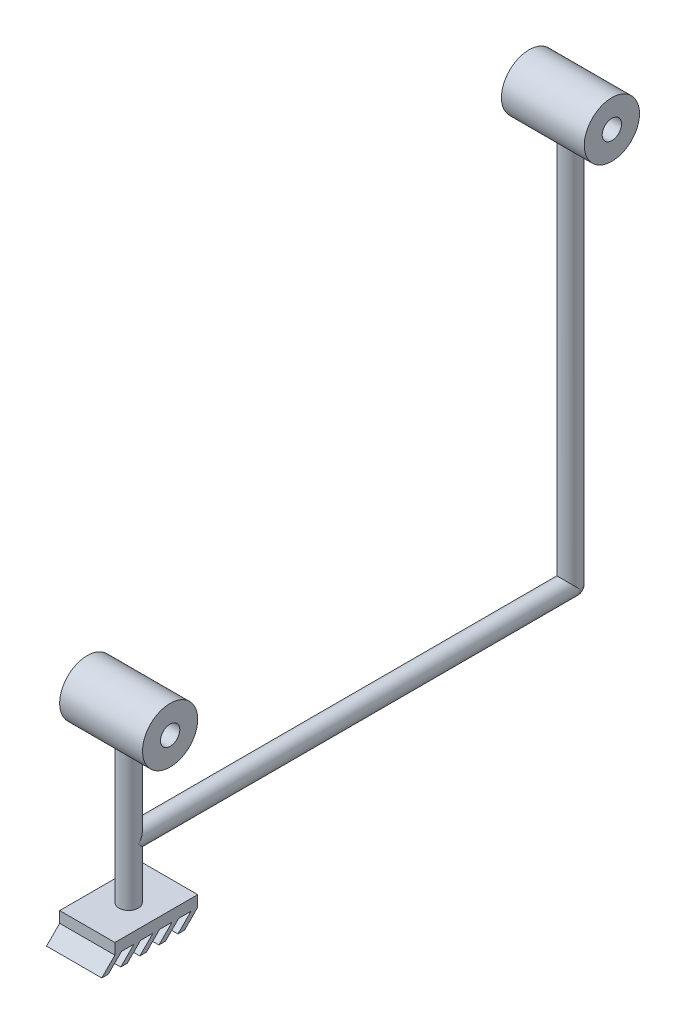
ISO-10303-21;
HEADER;
FILE_DESCRIPTION(('STEP AP214'),'2;1');
FILE_NAME('part.step','',(''),(''),'','','');
FILE_SCHEMA(('AUTOMOTIVE_DESIGN { 1 0 10303 214 1 1 1 1 }'));
ENDSEC;
DATA;
#1=APPLICATION_CONTEXT('core data for automotive mechanical design processes');
#2=APPLICATION_PROTOCOL_DEFINITION('international standard','automotive_design',2000,#1);
#3=PRODUCT_CONTEXT('',#1,'mechanical');
#4=PRODUCT('Part','Part','',(#3));
#5=PRODUCT_RELATED_PRODUCT_CATEGORY('part','',(#4));
#6=PRODUCT_DEFINITION_FORMATION('','',#4);
#7=PRODUCT_DEFINITION_CONTEXT('part definition',#1,'design');
#8=PRODUCT_DEFINITION('design','',#6,#7);
#9=PRODUCT_DEFINITION_SHAPE('','',#8);
#10=(LENGTH_UNIT() NAMED_UNIT(*) SI_UNIT(.MILLI.,.METRE.));
#11=(NAMED_UNIT(*) PLANE_ANGLE_UNIT() SI_UNIT($,.RADIAN.));
#12=(NAMED_UNIT(*) SI_UNIT($,.STERADIAN.) SOLID_ANGLE_UNIT());
#13=UNCERTAINTY_MEASURE_WITH_UNIT(LENGTH_MEASURE(1.E-05),#10,'distance_accuracy_value','');
#14=(GEOMETRIC_REPRESENTATION_CONTEXT(3) GLOBAL_UNCERTAINTY_ASSIGNED_CONTEXT((#13)) GLOBAL_UNIT_ASSIGNED_CONTEXT((#10,
#11,#12)) REPRESENTATION_CONTEXT('',''));
#15=CARTESIAN_POINT('',(0.,0.,0.));
#16=DIRECTION('',(0.,0.,1.));
#17=DIRECTION('',(1.,0.,0.));
#18=AXIS2_PLACEMENT_3D('',#15,#16,#17);
#19=CARTESIAN_POINT('',(10.,-24.,15.));
#20=DIRECTION('',(0.,1.,0.));
#21=DIRECTION('',(0.,0.,1.));
#22=AXIS2_PLACEMENT_3D('',#19,#20,#21);
#23=PLANE('',#22);
#24=DIRECTION('',(0.,0.,-1.));
#25=VECTOR('',#24,1.);
#26=CARTESIAN_POINT('',(-10.,-24.,15.));
#27=LINE('',#26,#25);
#28=CARTESIAN_POINT('',(-10.,-24.,-8.08471434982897));
#29=VERTEX_POINT('',#28);
#30=CARTESIAN_POINT('',(-10.,-24.,-12.6));
#31=VERTEX_POINT('',#30);
#32=EDGE_CURVE('E361',#29,#31,#27,.T.);
#33=ORIENTED_EDGE('',*,*,#32,.T.);
#34=DIRECTION('',(1.,0.,0.));
#35=VECTOR('',#34,1.);
#36=CARTESIAN_POINT('',(-18.5982098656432,-24.,-12.6));
#37=LINE('',#36,#35);
#38=CARTESIAN_POINT('',(10.,-24.,-12.6));
#39=VERTEX_POINT('',#38);
#40=EDGE_CURVE('E50',#31,#39,#37,.T.);
#41=ORIENTED_EDGE('',*,*,#40,.T.);
#42=DIRECTION('',(0.,0.,1.));
#43=VECTOR('',#42,1.);
#44=CARTESIAN_POINT('',(10.,-24.,15.));
#45=LINE('',#44,#43);
#46=CARTESIAN_POINT('',(10.,-24.,-8.08471434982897));
#47=VERTEX_POINT('',#46);
#48=EDGE_CURVE('E36',#39,#47,#45,.T.);
#49=ORIENTED_EDGE('',*,*,#48,.T.);
#50=DIRECTION('',(1.,0.,0.));
#51=VECTOR('',#50,1.);
#52=CARTESIAN_POINT('',(-18.5982098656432,-24.,-8.08471434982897));
#53=LINE('',#52,#51);
#54=EDGE_CURVE('E256',#29,#47,#53,.T.);
#55=ORIENTED_EDGE('',*,*,#54,.F.);
#56=EDGE_LOOP('',(#33,#41,#49,#55));
#57=FACE_BOUND('',#56,.T.);
#58=ADVANCED_FACE('F32',(#57),#23,.F.);
#59=CARTESIAN_POINT('',(-10.,-24.,-1.18471434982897));
#60=VERTEX_POINT('',#59);
#61=CARTESIAN_POINT('',(-10.,-24.,-5.7));
#62=VERTEX_POINT('',#61);
#63=EDGE_CURVE('E346',#60,#62,#27,.T.);
#64=ORIENTED_EDGE('',*,*,#63,.T.);
#65=DIRECTION('',(1.,0.,0.));
#66=VECTOR('',#65,1.);
#67=CARTESIAN_POINT('',(-18.5982098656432,-24.,-5.70000000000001));
#68=LINE('',#67,#66);
#69=CARTESIAN_POINT('',(10.,-24.,-5.70000000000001));
#70=VERTEX_POINT('',#69);
#71=EDGE_CURVE('E243',#62,#70,#68,.T.);
#72=ORIENTED_EDGE('',*,*,#71,.T.);
#73=CARTESIAN_POINT('',(10.,-24.,-1.18471434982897));
#74=VERTEX_POINT('',#73);
#75=EDGE_CURVE('E365',#70,#74,#45,.T.);
#76=ORIENTED_EDGE('',*,*,#75,.T.);
#77=DIRECTION('',(1.,0.,0.));
#78=VECTOR('',#77,1.);
#79=CARTESIAN_POINT('',(-18.5982098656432,-24.,-1.18471434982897));
#80=LINE('',#79,#78);
#81=EDGE_CURVE('E281',#60,#74,#80,.T.);
#82=ORIENTED_EDGE('',*,*,#81,.F.);
#83=EDGE_LOOP('',(#64,#72,#76,#82));
#84=FACE_BOUND('',#83,.T.);
#85=ADVANCED_FACE('F502',(#84),#23,.F.);
#86=CARTESIAN_POINT('',(-10.,-24.,5.71528565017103));
#87=VERTEX_POINT('',#86);
#88=CARTESIAN_POINT('',(-10.,-24.,1.2));
#89=VERTEX_POINT('',#88);
#90=EDGE_CURVE('E344',#87,#89,#27,.T.);
#91=ORIENTED_EDGE('',*,*,#90,.T.);
#92=DIRECTION('',(1.,0.,0.));
#93=VECTOR('',#92,1.);
#94=CARTESIAN_POINT('',(-18.5982098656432,-24.,1.2));
#95=LINE('',#94,#93);
#96=CARTESIAN_POINT('',(10.,-24.,1.2));
#97=VERTEX_POINT('',#96);
#98=EDGE_CURVE('E267',#89,#97,#95,.T.);
#99=ORIENTED_EDGE('',*,*,#98,.T.);
#100=CARTESIAN_POINT('',(10.,-24.,5.71528565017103));
#101=VERTEX_POINT('',#100);
#102=EDGE_CURVE('E364',#97,#101,#45,.T.);
#103=ORIENTED_EDGE('',*,*,#102,.T.);
#104=DIRECTION('',(1.,0.,0.));
#105=VECTOR('',#104,1.);
#106=CARTESIAN_POINT('',(-18.5982098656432,-24.,5.71528565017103));
#107=LINE('',#106,#105);
#108=EDGE_CURVE('E306',#87,#101,#107,.T.);
#109=ORIENTED_EDGE('',*,*,#108,.F.);
#110=EDGE_LOOP('',(#91,#99,#103,#109));
#111=FACE_BOUND('',#110,.T.);
#112=ADVANCED_FACE('F506',(#111),#23,.F.);
#113=CARTESIAN_POINT('',(-10.,-24.,12.615285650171));
#114=VERTEX_POINT('',#113);
#115=CARTESIAN_POINT('',(-10.,-24.,8.1));
#116=VERTEX_POINT('',#115);
#117=EDGE_CURVE('E332',#114,#116,#27,.T.);
#118=ORIENTED_EDGE('',*,*,#117,.T.);
#119=DIRECTION('',(1.,0.,0.));
#120=VECTOR('',#119,1.);
#121=CARTESIAN_POINT('',(-18.5982098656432,-24.,8.1));
#122=LINE('',#121,#120);
#123=CARTESIAN_POINT('',(10.,-24.,8.1));
#124=VERTEX_POINT('',#123);
#125=EDGE_CURVE('E292',#116,#124,#122,.T.);
#126=ORIENTED_EDGE('',*,*,#125,.T.);
#127=CARTESIAN_POINT('',(10.,-24.,12.615285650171));
#128=VERTEX_POINT('',#127);
#129=EDGE_CURVE('E347',#124,#128,#45,.T.);
#130=ORIENTED_EDGE('',*,*,#129,.T.);
#131=DIRECTION('',(1.,0.,0.));
#132=VECTOR('',#131,1.);
#133=CARTESIAN_POINT('',(-18.5982098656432,-24.,12.615285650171));
#134=LINE('',#133,#132);
#135=EDGE_CURVE('E317',#114,#128,#134,.T.);
#136=ORIENTED_EDGE('',*,*,#135,.F.);
#137=EDGE_LOOP('',(#118,#126,#130,#136));
#138=FACE_BOUND('',#137,.T.);
#139=ADVANCED_FACE('F428',(#138),#23,.F.);
#140=CARTESIAN_POINT('',(10.,-24.,-15.));
#141=VERTEX_POINT('',#140);
#142=CARTESIAN_POINT('',(10.,-24.,-14.984714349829));
#143=VERTEX_POINT('',#142);
#144=EDGE_CURVE('E58',#141,#143,#45,.T.);
#145=ORIENTED_EDGE('',*,*,#144,.T.);
#146=DIRECTION('',(1.,0.,0.));
#147=VECTOR('',#146,1.);
#148=CARTESIAN_POINT('',(-18.5982098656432,-24.,-14.984714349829));
#149=LINE('',#148,#147);
#150=CARTESIAN_POINT('',(-10.,-24.,-14.984714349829));
#151=VERTEX_POINT('',#150);
#152=EDGE_CURVE('E234',#151,#143,#149,.T.);
#153=ORIENTED_EDGE('',*,*,#152,.F.);
#154=CARTESIAN_POINT('',(-10.,-24.,-15.));
#155=VERTEX_POINT('',#154);
#156=EDGE_CURVE('E363',#151,#155,#27,.T.);
#157=ORIENTED_EDGE('',*,*,#156,.T.);
#158=DIRECTION('',(1.,0.,0.));
#159=VECTOR('',#158,1.);
#160=CARTESIAN_POINT('',(10.,-24.,-15.));
#161=LINE('',#160,#159);
#162=EDGE_CURVE('E353',#155,#141,#161,.T.);
#163=ORIENTED_EDGE('',*,*,#162,.T.);
#164=EDGE_LOOP('',(#145,#153,#157,#163));
#165=FACE_BOUND('',#164,.T.);
#166=ADVANCED_FACE('F425',(#165),#23,.F.);
#167=CARTESIAN_POINT('',(0.,0.,-160.));
#168=DIRECTION('',(0.,0.,1.));
#169=DIRECTION('',(1.,0.,0.));
#170=AXIS2_PLACEMENT_3D('',#167,#168,#169);
#171=CYLINDRICAL_SURFACE('',#170,3.5);
#172=CARTESIAN_POINT('',(0.,0.,-160.));
#173=DIRECTION('',(0.,0.,1.));
#174=DIRECTION('',(1.,0.,0.));
#175=AXIS2_PLACEMENT_3D('',#172,#173,#174);
#176=CIRCLE('',#175,3.5);
#177=CARTESIAN_POINT('',(-3.5,0.,-160.));
#178=VERTEX_POINT('',#177);
#179=CARTESIAN_POINT('',(3.5,0.,-160.));
#180=VERTEX_POINT('',#179);
#181=EDGE_CURVE('E583',#178,#180,#176,.T.);
#182=ORIENTED_EDGE('',*,*,#181,.T.);
#183=CARTESIAN_POINT('',(0.,0.,-160.));
#184=DIRECTION('',(0.,-0.707106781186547,0.707106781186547));
#185=DIRECTION('',(0.,0.707106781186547,0.707106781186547));
#186=AXIS2_PLACEMENT_3D('',#183,#184,#185);
#187=ELLIPSE('',#186,4.94974746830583,3.5);
#188=EDGE_CURVE('E572',#180,#178,#187,.T.);
#189=ORIENTED_EDGE('',*,*,#188,.T.);
#190=EDGE_LOOP('',(#182,#189));
#191=FACE_BOUND('',#190,.T.);
#192=CARTESIAN_POINT('',(0.,0.,0.));
#193=DIRECTION('',(0.,0.707106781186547,0.707106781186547));
#194=DIRECTION('',(0.,-0.707106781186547,0.707106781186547));
#195=AXIS2_PLACEMENT_3D('',#192,#193,#194);
#196=ELLIPSE('',#195,4.94974746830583,3.5);
#197=CARTESIAN_POINT('',(-3.5,0.,0.));
#198=VERTEX_POINT('',#197);
#199=CARTESIAN_POINT('',(3.5,0.,0.));
#200=VERTEX_POINT('',#199);
#201=EDGE_CURVE('E581',#198,#200,#196,.F.);
#202=ORIENTED_EDGE('',*,*,#201,.T.);
#203=CARTESIAN_POINT('',(0.,0.,0.));
#204=DIRECTION('',(0.,-0.707106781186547,0.707106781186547));
#205=DIRECTION('',(0.,0.707106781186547,0.707106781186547));
#206=AXIS2_PLACEMENT_3D('',#203,#204,#205);
#207=ELLIPSE('',#206,4.94974746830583,3.5);
#208=EDGE_CURVE('E561',#200,#198,#207,.F.);
#209=ORIENTED_EDGE('',*,*,#208,.T.);
#210=EDGE_LOOP('',(#202,#209));
#211=FACE_BOUND('',#210,.T.);
#212=ADVANCED_FACE('F34',(#191,#211),#171,.T.);
#213=CARTESIAN_POINT('',(0.,150.,-160.));
#214=DIRECTION('',(0.,-1.,0.));
#215=DIRECTION('',(0.,0.,-1.));
#216=AXIS2_PLACEMENT_3D('',#213,#214,#215);
#217=CYLINDRICAL_SURFACE('',#216,3.5);
#218=ORIENTED_EDGE('',*,*,#188,.F.);
#219=CARTESIAN_POINT('',(0.,0.,-160.));
#220=DIRECTION('',(0.,1.,0.));
#221=DIRECTION('',(0.,0.,1.));
#222=AXIS2_PLACEMENT_3D('',#219,#220,#221);
#223=CIRCLE('',#222,3.5);
#224=EDGE_CURVE('E569',#180,#178,#223,.T.);
#225=ORIENTED_EDGE('',*,*,#224,.T.);
#226=EDGE_LOOP('',(#218,#225));
#227=FACE_BOUND('',#226,.T.);
#228=CARTESIAN_POINT('',(0.,140.632503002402,-163.5));
#229=CARTESIAN_POINT('',(-0.190015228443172,140.632505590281,-163.500003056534));
#230=CARTESIAN_POINT('',(-0.380009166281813,140.626658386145,-163.484474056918));
#231=CARTESIAN_POINT('',(-0.754329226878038,140.604038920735,-163.423005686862));
#232=CARTESIAN_POINT('',(-0.938654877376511,140.587265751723,-163.377063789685));
#233=CARTESIAN_POINT('',(-1.29614668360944,140.544922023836,-163.256612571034));
#234=CARTESIAN_POINT('',(-1.46933564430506,140.519370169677,-163.182163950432));
#235=CARTESIAN_POINT('',(-1.80082676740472,140.462376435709,-163.007023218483));
#236=CARTESIAN_POINT('',(-1.95912513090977,140.430933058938,-162.906324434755));
#237=CARTESIAN_POINT('',(-2.26317861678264,140.364176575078,-162.676882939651));
#238=CARTESIAN_POINT('',(-2.40819784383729,140.328760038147,-162.547194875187));
#239=CARTESIAN_POINT('',(-2.67493749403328,140.258917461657,-162.265469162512));
#240=CARTESIAN_POINT('',(-2.79665372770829,140.224491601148,-162.113427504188));
#241=CARTESIAN_POINT('',(-3.01675012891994,140.159299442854,-161.785850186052));
#242=CARTESIAN_POINT('',(-3.11434809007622,140.128668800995,-161.609759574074));
#243=CARTESIAN_POINT('',(-3.27823961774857,140.075746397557,-161.242401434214));
#244=CARTESIAN_POINT('',(-3.34454254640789,140.053452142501,-161.051138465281));
#245=CARTESIAN_POINT('',(-3.44143357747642,140.020447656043,-160.666588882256));
#246=CARTESIAN_POINT('',(-3.47328474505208,140.009328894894,-160.473656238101));
#247=CARTESIAN_POINT('',(-3.50439617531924,139.998471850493,-160.084885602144));
#248=CARTESIAN_POINT('',(-3.50366568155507,139.998730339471,-159.889048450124));
#249=CARTESIAN_POINT('',(-3.47041038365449,140.0103283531,-159.50901145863));
#250=CARTESIAN_POINT('',(-3.43925996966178,140.021188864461,-159.324674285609));
#251=CARTESIAN_POINT('',(-3.34833697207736,140.052158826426,-158.964031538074));
#252=CARTESIAN_POINT('',(-3.28856240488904,140.072268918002,-158.7877265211));
#253=CARTESIAN_POINT('',(-3.14135069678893,140.120061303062,-158.445285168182));
#254=CARTESIAN_POINT('',(-3.05354374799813,140.147844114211,-158.27932241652));
#255=CARTESIAN_POINT('',(-2.853072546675,140.208120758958,-157.964098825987));
#256=CARTESIAN_POINT('',(-2.74040091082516,140.240615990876,-157.814842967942));
#257=CARTESIAN_POINT('',(-2.48658785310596,140.308898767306,-157.529120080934));
#258=CARTESIAN_POINT('',(-2.3442779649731,140.34476967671,-157.393709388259));
#259=CARTESIAN_POINT('',(-2.03869601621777,140.414376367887,-157.148311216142));
#260=CARTESIAN_POINT('',(-1.87542000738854,140.448111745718,-157.038328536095));
#261=CARTESIAN_POINT('',(-1.52887993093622,140.510111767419,-156.845238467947));
#262=CARTESIAN_POINT('',(-1.34532137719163,140.538272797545,-156.762623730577));
#263=CARTESIAN_POINT('',(-0.965658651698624,140.584740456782,-156.629852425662));
#264=CARTESIAN_POINT('',(-0.769560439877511,140.603051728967,-156.579680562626));
#265=CARTESIAN_POINT('',(-0.38070325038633,140.626678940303,-156.515466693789));
#266=CARTESIAN_POINT('',(-0.188253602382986,140.632589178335,-156.499770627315));
#267=CARTESIAN_POINT('',(0.19657916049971,140.632414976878,-156.500234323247));
#268=CARTESIAN_POINT('',(0.38896228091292,140.626333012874,-156.516387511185));
#269=CARTESIAN_POINT('',(0.760318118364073,140.603456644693,-156.578599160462));
#270=CARTESIAN_POINT('',(0.939520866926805,140.587091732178,-156.623459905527));
#271=CARTESIAN_POINT('',(1.28780306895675,140.545980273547,-156.740349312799));
#272=CARTESIAN_POINT('',(1.45688060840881,140.521232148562,-156.812383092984));
#273=CARTESIAN_POINT('',(1.78650944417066,140.465100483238,-156.984354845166));
#274=CARTESIAN_POINT('',(1.94657352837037,140.433519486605,-157.085160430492));
#275=CARTESIAN_POINT('',(2.24810844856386,140.367643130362,-157.31085499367));
#276=CARTESIAN_POINT('',(2.38957324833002,140.333346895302,-157.435751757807));
#277=CARTESIAN_POINT('',(2.65778728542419,140.26366880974,-157.714067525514));
#278=CARTESIAN_POINT('',(2.78333219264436,140.228328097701,-157.86866111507));
#279=CARTESIAN_POINT('',(3.00680180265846,140.162346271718,-158.197594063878));
#280=CARTESIAN_POINT('',(3.10472714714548,140.131705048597,-158.371932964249));
#281=CARTESIAN_POINT('',(3.26935426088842,140.078678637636,-158.734783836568));
#282=CARTESIAN_POINT('',(3.33622971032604,140.056247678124,-158.923209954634));
#283=CARTESIAN_POINT('',(3.43702558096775,140.021980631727,-159.309585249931));
#284=CARTESIAN_POINT('',(3.47095926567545,140.010140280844,-159.507530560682));
#285=CARTESIAN_POINT('',(3.50362041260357,139.998742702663,-159.896363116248));
#286=CARTESIAN_POINT('',(3.50406912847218,139.998584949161,-160.087089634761));
#287=CARTESIAN_POINT('',(3.47406390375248,140.009057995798,-160.465775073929));
#288=CARTESIAN_POINT('',(3.44361291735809,140.019687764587,-160.653734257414));
#289=CARTESIAN_POINT('',(3.35384530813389,140.05029876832,-161.01796363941));
#290=CARTESIAN_POINT('',(3.29508802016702,140.070098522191,-161.19438805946));
#291=CARTESIAN_POINT('',(3.15090729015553,140.11700528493,-161.53492402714));
#292=CARTESIAN_POINT('',(3.06547889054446,140.144113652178,-161.699033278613));
#293=CARTESIAN_POINT('',(2.86654561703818,140.204196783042,-162.017300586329));
#294=CARTESIAN_POINT('',(2.75207211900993,140.23735973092,-162.170817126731));
#295=CARTESIAN_POINT('',(2.49989733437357,140.305426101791,-162.45701356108));
#296=CARTESIAN_POINT('',(2.36218826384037,140.340330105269,-162.589686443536));
#297=CARTESIAN_POINT('',(2.06016290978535,140.409808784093,-162.836442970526));
#298=CARTESIAN_POINT('',(1.89493733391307,140.444300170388,-162.949440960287));
#299=CARTESIAN_POINT('',(1.54675228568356,140.507203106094,-163.146030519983));
#300=CARTESIAN_POINT('',(1.36379511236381,140.535615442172,-163.229625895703));
#301=CARTESIAN_POINT('',(0.987195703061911,140.582457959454,-163.363768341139));
#302=CARTESIAN_POINT('',(0.793694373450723,140.600995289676,-163.414671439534));
#303=CARTESIAN_POINT('',(0.400118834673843,140.626013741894,-163.482778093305));
#304=CARTESIAN_POINT('',(0.200047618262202,140.63250027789,-163.499996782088));
#305=CARTESIAN_POINT('',(0.,140.632503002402,-163.5));
#306=B_SPLINE_CURVE_WITH_KNOTS('',3,(#228,#229,#230,#231,#232,#233,#234,#235,#236,#237,#238,
#239,#240,#241,#242,#243,#244,#245,#246,#247,#248,#249,#250,#251,#252,#253,#254,#255,#256,#257,
#258,#259,#260,#261,#262,#263,#264,#265,#266,#267,#268,#269,#270,#271,#272,#273,#274,#275,#276,
#277,#278,#279,#280,#281,#282,#283,#284,#285,#286,#287,#288,#289,#290,#291,#292,#293,#294,#295,
#296,#297,#298,#299,#300,#301,#302,#303,#304,#305),.UNSPECIFIED.,.T.,.F.,(4,2,2,2,2,2,2,2,2,2,2,
2,2,2,2,2,2,2,2,2,2,2,2,2,2,2,2,2,2,2,2,2,2,2,2,2,2,2,4),(0.,0.569303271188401,1.13865384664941,
1.70679875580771,2.27508821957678,2.86567632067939,3.456370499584,4.06425497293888,
4.67195747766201,5.25653473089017,5.84094613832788,6.40011991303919,6.95933244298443,
7.52625023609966,8.09333659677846,8.68966509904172,9.2861060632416,9.89276413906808,
10.499135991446,11.0757147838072,11.6521745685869,12.2060258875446,12.7599815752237,
13.3328233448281,13.9058505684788,14.5097673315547,15.1136700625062,15.7141528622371,
16.3143937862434,16.8837576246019,17.4530670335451,18.0115615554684,18.5701599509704,
19.150637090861,19.7313090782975,20.3377389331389,20.9440902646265,21.5437209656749,
22.1430822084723),.UNSPECIFIED.);
#307=CARTESIAN_POINT('',(0.,140.632503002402,-163.5));
#308=VERTEX_POINT('',#307);
#309=EDGE_CURVE('E11',#308,#308,#306,.T.);
#310=ORIENTED_EDGE('',*,*,#309,.F.);
#311=EDGE_LOOP('',(#310));
#312=FACE_BOUND('',#311,.T.);
#313=ADVANCED_FACE('F392',(#227,#312),#217,.T.);
#314=CARTESIAN_POINT('',(0.,40.,0.));
#315=DIRECTION('',(0.,-1.,0.));
#316=DIRECTION('',(0.,0.,-1.));
#317=AXIS2_PLACEMENT_3D('',#314,#315,#316);
#318=CYLINDRICAL_SURFACE('',#317,3.5);
#319=ORIENTED_EDGE('',*,*,#201,.F.);
#320=ORIENTED_EDGE('',*,*,#208,.F.);
#321=EDGE_LOOP('',(#319,#320));
#322=FACE_BOUND('',#321,.T.);
#323=CARTESIAN_POINT('',(0.,30.6325030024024,-3.5));
#324=CARTESIAN_POINT('',(-0.19001522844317,30.6325055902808,-3.50000305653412));
#325=CARTESIAN_POINT('',(-0.380009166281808,30.6266583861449,-3.48447405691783));
#326=CARTESIAN_POINT('',(-0.754329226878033,30.6040389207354,-3.42300568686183));
#327=CARTESIAN_POINT('',(-0.938654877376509,30.5872657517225,-3.37706378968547));
#328=CARTESIAN_POINT('',(-1.29614668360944,30.5449220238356,-3.2566125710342));
#329=CARTESIAN_POINT('',(-1.46933564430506,30.5193701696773,-3.18216395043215));
#330=CARTESIAN_POINT('',(-1.80082676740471,30.462376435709,-3.00702321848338));
#331=CARTESIAN_POINT('',(-1.95912513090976,30.4309330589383,-2.90632443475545));
#332=CARTESIAN_POINT('',(-2.26317861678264,30.3641765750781,-2.67688293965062));
#333=CARTESIAN_POINT('',(-2.40819784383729,30.3287600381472,-2.54719487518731));
#334=CARTESIAN_POINT('',(-2.67493749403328,30.2589174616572,-2.26546916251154));
#335=CARTESIAN_POINT('',(-2.79665372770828,30.2244916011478,-2.11342750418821));
#336=CARTESIAN_POINT('',(-3.01675012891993,30.159299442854,-1.78585018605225));
#337=CARTESIAN_POINT('',(-3.11434809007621,30.1286688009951,-1.60975957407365));
#338=CARTESIAN_POINT('',(-3.27823961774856,30.0757463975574,-1.2424014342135));
#339=CARTESIAN_POINT('',(-3.34454254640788,30.0534521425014,-1.05113846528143));
#340=CARTESIAN_POINT('',(-3.44143357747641,30.0204476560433,-0.666588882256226));
#341=CARTESIAN_POINT('',(-3.47328474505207,30.0093288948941,-0.473656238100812));
#342=CARTESIAN_POINT('',(-3.50439617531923,29.9984718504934,-0.0848856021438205));
#343=CARTESIAN_POINT('',(-3.50366568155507,29.9987303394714,0.110951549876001));
#344=CARTESIAN_POINT('',(-3.47041038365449,30.0103283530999,0.490988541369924));
#345=CARTESIAN_POINT('',(-3.43925996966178,30.0211888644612,0.675325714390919));
#346=CARTESIAN_POINT('',(-3.34833697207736,30.0521588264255,1.03596846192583));
#347=CARTESIAN_POINT('',(-3.28856240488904,30.072268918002,1.21227347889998));
#348=CARTESIAN_POINT('',(-3.14135069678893,30.1200613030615,1.55471483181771));
#349=CARTESIAN_POINT('',(-3.05354374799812,30.147844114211,1.72067758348));
#350=CARTESIAN_POINT('',(-2.85307254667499,30.2081207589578,2.03590117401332));
#351=CARTESIAN_POINT('',(-2.74040091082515,30.2406159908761,2.18515703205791));
#352=CARTESIAN_POINT('',(-2.48658785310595,30.308898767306,2.47087991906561));
#353=CARTESIAN_POINT('',(-2.3442779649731,30.34476967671,2.60629061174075));
#354=CARTESIAN_POINT('',(-2.03869601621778,30.4143763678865,2.85168878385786));
#355=CARTESIAN_POINT('',(-1.87542000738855,30.4481117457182,2.9616714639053));
#356=CARTESIAN_POINT('',(-1.52887993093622,30.5101117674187,3.15476153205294));
#357=CARTESIAN_POINT('',(-1.34532137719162,30.5382727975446,3.23737626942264));
#358=CARTESIAN_POINT('',(-0.96565865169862,30.5847404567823,3.37014757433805));
#359=CARTESIAN_POINT('',(-0.769560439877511,30.6030517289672,3.42031943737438));
#360=CARTESIAN_POINT('',(-0.380703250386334,30.6266789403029,3.48453330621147));
#361=CARTESIAN_POINT('',(-0.18825360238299,30.6325891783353,3.50022937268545));
#362=CARTESIAN_POINT('',(0.196579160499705,30.6324149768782,3.49976567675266));
#363=CARTESIAN_POINT('',(0.388962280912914,30.6263330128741,3.48361248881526));
#364=CARTESIAN_POINT('',(0.760318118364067,30.6034566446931,3.42140083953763));
#365=CARTESIAN_POINT('',(0.9395208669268,30.5870917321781,3.37654009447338));
#366=CARTESIAN_POINT('',(1.28780306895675,30.5459802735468,3.25965068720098));
#367=CARTESIAN_POINT('',(1.45688060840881,30.5212321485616,3.18761690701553));
#368=CARTESIAN_POINT('',(1.78650944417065,30.4651004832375,3.01564515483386));
#369=CARTESIAN_POINT('',(1.94657352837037,30.4335194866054,2.91483956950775));
#370=CARTESIAN_POINT('',(2.24810844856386,30.3676431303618,2.68914500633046));
#371=CARTESIAN_POINT('',(2.38957324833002,30.3333468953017,2.56424824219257));
#372=CARTESIAN_POINT('',(2.6577872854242,30.2636688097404,2.28593247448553));
#373=CARTESIAN_POINT('',(2.78333219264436,30.2283280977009,2.13133888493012));
#374=CARTESIAN_POINT('',(3.00680180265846,30.1623462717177,1.80240593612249));
#375=CARTESIAN_POINT('',(3.10472714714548,30.131705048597,1.62806703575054));
#376=CARTESIAN_POINT('',(3.26935426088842,30.0786786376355,1.26521616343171));
#377=CARTESIAN_POINT('',(3.33622971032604,30.0562476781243,1.07679004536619));
#378=CARTESIAN_POINT('',(3.43702558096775,30.0219806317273,0.69041475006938));
#379=CARTESIAN_POINT('',(3.47095926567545,30.0101402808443,0.492469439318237));
#380=CARTESIAN_POINT('',(3.50362041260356,29.9987427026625,0.103636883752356));
#381=CARTESIAN_POINT('',(3.50406912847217,29.9985849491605,-0.0870896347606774));
#382=CARTESIAN_POINT('',(3.47406390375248,30.0090579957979,-0.4657750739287));
#383=CARTESIAN_POINT('',(3.44361291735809,30.0196877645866,-0.653734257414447));
#384=CARTESIAN_POINT('',(3.35384530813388,30.0502987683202,-1.01796363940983));
#385=CARTESIAN_POINT('',(3.29508802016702,30.0700985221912,-1.19438805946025));
#386=CARTESIAN_POINT('',(3.15090729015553,30.1170052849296,-1.53492402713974));
#387=CARTESIAN_POINT('',(3.06547889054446,30.1441136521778,-1.69903327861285));
#388=CARTESIAN_POINT('',(2.86654561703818,30.2041967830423,-2.01730058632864));
#389=CARTESIAN_POINT('',(2.75207211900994,30.2373597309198,-2.17081712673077));
#390=CARTESIAN_POINT('',(2.49989733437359,30.3054261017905,-2.45701356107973));
#391=CARTESIAN_POINT('',(2.36218826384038,30.3403301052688,-2.58968644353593));
#392=CARTESIAN_POINT('',(2.06016290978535,30.4098087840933,-2.83644297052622));
#393=CARTESIAN_POINT('',(1.89493733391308,30.4443001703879,-2.94944096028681));
#394=CARTESIAN_POINT('',(1.54675228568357,30.5072031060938,-3.1460305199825));
#395=CARTESIAN_POINT('',(1.36379511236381,30.5356154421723,-3.22962589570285));
#396=CARTESIAN_POINT('',(0.987195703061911,30.582457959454,-3.36376834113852));
#397=CARTESIAN_POINT('',(0.793694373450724,30.6009952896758,-3.41467143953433));
#398=CARTESIAN_POINT('',(0.400118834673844,30.6260137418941,-3.48277809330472));
#399=CARTESIAN_POINT('',(0.200047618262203,30.6325002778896,-3.49999678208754));
#400=CARTESIAN_POINT('',(0.,30.6325030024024,-3.5));
#401=B_SPLINE_CURVE_WITH_KNOTS('',3,(#323,#324,#325,#326,#327,#328,#329,#330,#331,#332,#333,
#334,#335,#336,#337,#338,#339,#340,#341,#342,#343,#344,#345,#346,#347,#348,#349,#350,#351,#352,
#353,#354,#355,#356,#357,#358,#359,#360,#361,#362,#363,#364,#365,#366,#367,#368,#369,#370,#371,
#372,#373,#374,#375,#376,#377,#378,#379,#380,#381,#382,#383,#384,#385,#386,#387,#388,#389,#390,
#391,#392,#393,#394,#395,#396,#397,#398,#399,#400),.UNSPECIFIED.,.T.,.F.,(4,2,2,2,2,2,2,2,2,2,2,
2,2,2,2,2,2,2,2,2,2,2,2,2,2,2,2,2,2,2,2,2,2,2,2,2,2,2,4),(0.,0.569303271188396,1.13865384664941,
1.7067987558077,2.27508821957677,2.86567632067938,3.45637049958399,4.06425497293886,
4.67195747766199,5.25653473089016,5.84094613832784,6.40011991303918,6.9593324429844,
7.52625023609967,8.09333659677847,8.68966509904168,9.28610606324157,9.89276413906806,
10.4991359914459,11.0757147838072,11.6521745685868,12.2060258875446,12.7599815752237,
13.3328233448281,13.9058505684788,14.5097673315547,15.1136700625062,15.7141528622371,
16.3143937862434,16.8837576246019,17.453067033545,18.0115615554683,18.5701599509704,
19.1506370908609,19.7313090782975,20.3377389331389,20.9440902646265,21.5437209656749,
22.1430822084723),.UNSPECIFIED.);
#402=CARTESIAN_POINT('',(0.,30.6325030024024,-3.5));
#403=VERTEX_POINT('',#402);
#404=EDGE_CURVE('E42',#403,#403,#401,.T.);
#405=ORIENTED_EDGE('',*,*,#404,.F.);
#406=EDGE_LOOP('',(#405));
#407=FACE_BOUND('',#406,.T.);
#408=CARTESIAN_POINT('',(0.,-20.,0.));
#409=DIRECTION('',(0.,-1.,0.));
#410=DIRECTION('',(0.,0.,-1.));
#411=AXIS2_PLACEMENT_3D('',#408,#409,#410);
#412=CIRCLE('',#411,3.5);
#413=CARTESIAN_POINT('',(0.,-20.,-3.5));
#414=VERTEX_POINT('',#413);
#415=EDGE_CURVE('E558',#414,#414,#412,.T.);
#416=ORIENTED_EDGE('',*,*,#415,.F.);
#417=EDGE_LOOP('',(#416));
#418=FACE_BOUND('',#417,.T.);
#419=ADVANCED_FACE('F592',(#322,#407,#418),#318,.T.);
#420=CARTESIAN_POINT('',(15.,40.,0.));
#421=DIRECTION('',(-1.,0.,0.));
#422=DIRECTION('',(0.,0.,1.));
#423=AXIS2_PLACEMENT_3D('',#420,#421,#422);
#424=CYLINDRICAL_SURFACE('',#423,10.);
#425=CARTESIAN_POINT('',(-15.,40.,0.));
#426=DIRECTION('',(1.,0.,0.));
#427=DIRECTION('',(0.,0.,-1.));
#428=AXIS2_PLACEMENT_3D('',#425,#426,#427);
#429=CIRCLE('',#428,10.);
#430=CARTESIAN_POINT('',(-15.,40.,-10.));
#431=VERTEX_POINT('',#430);
#432=EDGE_CURVE('E575',#431,#431,#429,.T.);
#433=ORIENTED_EDGE('',*,*,#432,.T.);
#434=EDGE_LOOP('',(#433));
#435=FACE_BOUND('',#434,.T.);
#436=CARTESIAN_POINT('',(15.,40.,0.));
#437=DIRECTION('',(1.,0.,0.));
#438=DIRECTION('',(0.,0.,-1.));
#439=AXIS2_PLACEMENT_3D('',#436,#437,#438);
#440=CIRCLE('',#439,10.);
#441=CARTESIAN_POINT('',(15.,40.,-10.));
#442=VERTEX_POINT('',#441);
#443=EDGE_CURVE('E578',#442,#442,#440,.T.);
#444=ORIENTED_EDGE('',*,*,#443,.F.);
#445=EDGE_LOOP('',(#444));
#446=FACE_BOUND('',#445,.T.);
#447=ORIENTED_EDGE('',*,*,#404,.T.);
#448=EDGE_LOOP('',(#447));
#449=FACE_BOUND('',#448,.T.);
#450=ADVANCED_FACE('F590',(#435,#446,#449),#424,.T.);
#451=CARTESIAN_POINT('',(15.,40.,0.));
#452=DIRECTION('',(1.,0.,0.));
#453=DIRECTION('',(0.,0.,-1.));
#454=AXIS2_PLACEMENT_3D('',#451,#452,#453);
#455=PLANE('',#454);
#456=CARTESIAN_POINT('',(15.,40.,0.));
#457=DIRECTION('',(1.,0.,0.));
#458=DIRECTION('',(0.,0.,-1.));
#459=AXIS2_PLACEMENT_3D('',#456,#457,#458);
#460=CIRCLE('',#459,3.5);
#461=CARTESIAN_POINT('',(15.,40.,-3.5));
#462=VERTEX_POINT('',#461);
#463=EDGE_CURVE('E378',#462,#462,#460,.T.);
#464=ORIENTED_EDGE('',*,*,#463,.F.);
#465=EDGE_LOOP('',(#464));
#466=FACE_BOUND('',#465,.T.);
#467=ORIENTED_EDGE('',*,*,#443,.T.);
#468=EDGE_LOOP('',(#467));
#469=FACE_BOUND('',#468,.T.);
#470=ADVANCED_FACE('F601',(#466,#469),#455,.T.);
#471=CARTESIAN_POINT('',(-15.,40.,0.));
#472=DIRECTION('',(1.,0.,0.));
#473=DIRECTION('',(0.,0.,-1.));
#474=AXIS2_PLACEMENT_3D('',#471,#472,#473);
#475=PLANE('',#474);
#476=CARTESIAN_POINT('',(-15.,40.,0.));
#477=DIRECTION('',(1.,0.,0.));
#478=DIRECTION('',(0.,0.,-1.));
#479=AXIS2_PLACEMENT_3D('',#476,#477,#478);
#480=CIRCLE('',#479,3.5);
#481=CARTESIAN_POINT('',(-15.,40.,-3.5));
#482=VERTEX_POINT('',#481);
#483=EDGE_CURVE('E380',#482,#482,#480,.T.);
#484=ORIENTED_EDGE('',*,*,#483,.T.);
#485=EDGE_LOOP('',(#484));
#486=FACE_BOUND('',#485,.T.);
#487=ORIENTED_EDGE('',*,*,#432,.F.);
#488=EDGE_LOOP('',(#487));
#489=FACE_BOUND('',#488,.T.);
#490=ADVANCED_FACE('F400',(#486,#489),#475,.F.);
#491=CARTESIAN_POINT('',(15.,150.,-160.));
#492=DIRECTION('',(-1.,0.,0.));
#493=DIRECTION('',(0.,0.,1.));
#494=AXIS2_PLACEMENT_3D('',#491,#492,#493);
#495=CYLINDRICAL_SURFACE('',#494,9.99999999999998);
#496=CARTESIAN_POINT('',(-15.,150.,-160.));
#497=DIRECTION('',(1.,0.,0.));
#498=DIRECTION('',(0.,0.,-1.));
#499=AXIS2_PLACEMENT_3D('',#496,#497,#498);
#500=CIRCLE('',#499,9.99999999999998);
#501=CARTESIAN_POINT('',(-15.,150.,-170.));
#502=VERTEX_POINT('',#501);
#503=EDGE_CURVE('E563',#502,#502,#500,.T.);
#504=ORIENTED_EDGE('',*,*,#503,.T.);
#505=EDGE_LOOP('',(#504));
#506=FACE_BOUND('',#505,.T.);
#507=CARTESIAN_POINT('',(15.,150.,-160.));
#508=DIRECTION('',(1.,0.,0.));
#509=DIRECTION('',(0.,0.,-1.));
#510=AXIS2_PLACEMENT_3D('',#507,#508,#509);
#511=CIRCLE('',#510,9.99999999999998);
#512=CARTESIAN_POINT('',(15.,150.,-170.));
#513=VERTEX_POINT('',#512);
#514=EDGE_CURVE('E566',#513,#513,#511,.T.);
#515=ORIENTED_EDGE('',*,*,#514,.F.);
#516=EDGE_LOOP('',(#515));
#517=FACE_BOUND('',#516,.T.);
#518=ORIENTED_EDGE('',*,*,#309,.T.);
#519=EDGE_LOOP('',(#518));
#520=FACE_BOUND('',#519,.T.);
#521=ADVANCED_FACE('F395',(#506,#517,#520),#495,.T.);
#522=CARTESIAN_POINT('',(15.,150.,-160.));
#523=DIRECTION('',(1.,0.,0.));
#524=DIRECTION('',(0.,0.,-1.));
#525=AXIS2_PLACEMENT_3D('',#522,#523,#524);
#526=PLANE('',#525);
#527=CARTESIAN_POINT('',(15.,150.,-160.));
#528=DIRECTION('',(1.,0.,0.));
#529=DIRECTION('',(0.,0.,-1.));
#530=AXIS2_PLACEMENT_3D('',#527,#528,#529);
#531=CIRCLE('',#530,3.49999999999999);
#532=CARTESIAN_POINT('',(15.,150.,-163.5));
#533=VERTEX_POINT('',#532);
#534=EDGE_CURVE('E379',#533,#533,#531,.T.);
#535=ORIENTED_EDGE('',*,*,#534,.F.);
#536=EDGE_LOOP('',(#535));
#537=FACE_BOUND('',#536,.T.);
#538=ORIENTED_EDGE('',*,*,#514,.T.);
#539=EDGE_LOOP('',(#538));
#540=FACE_BOUND('',#539,.T.);
#541=ADVANCED_FACE('F399',(#537,#540),#526,.T.);
#542=CARTESIAN_POINT('',(-15.,150.,-160.));
#543=DIRECTION('',(1.,0.,0.));
#544=DIRECTION('',(0.,0.,-1.));
#545=AXIS2_PLACEMENT_3D('',#542,#543,#544);
#546=PLANE('',#545);
#547=CARTESIAN_POINT('',(-15.,150.,-160.));
#548=DIRECTION('',(1.,0.,0.));
#549=DIRECTION('',(0.,0.,-1.));
#550=AXIS2_PLACEMENT_3D('',#547,#548,#549);
#551=CIRCLE('',#550,3.49999999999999);
#552=CARTESIAN_POINT('',(-15.,150.,-163.5));
#553=VERTEX_POINT('',#552);
#554=EDGE_CURVE('E375',#553,#553,#551,.T.);
#555=ORIENTED_EDGE('',*,*,#554,.T.);
#556=EDGE_LOOP('',(#555));
#557=FACE_BOUND('',#556,.T.);
#558=ORIENTED_EDGE('',*,*,#503,.F.);
#559=EDGE_LOOP('',(#558));
#560=FACE_BOUND('',#559,.T.);
#561=ADVANCED_FACE('F404',(#557,#560),#546,.F.);
#562=CARTESIAN_POINT('',(10.,-20.,15.));
#563=DIRECTION('',(0.,1.,0.));
#564=DIRECTION('',(0.,0.,1.));
#565=AXIS2_PLACEMENT_3D('',#562,#563,#564);
#566=PLANE('',#565);
#567=DIRECTION('',(0.,0.,1.));
#568=VECTOR('',#567,1.);
#569=CARTESIAN_POINT('',(10.,-20.,15.));
#570=LINE('',#569,#568);
#571=CARTESIAN_POINT('',(10.,-20.,-15.));
#572=VERTEX_POINT('',#571);
#573=CARTESIAN_POINT('',(10.,-20.,15.));
#574=VERTEX_POINT('',#573);
#575=EDGE_CURVE('E382',#572,#574,#570,.T.);
#576=ORIENTED_EDGE('',*,*,#575,.F.);
#577=DIRECTION('',(1.,0.,0.));
#578=VECTOR('',#577,1.);
#579=CARTESIAN_POINT('',(10.,-20.,-15.));
#580=LINE('',#579,#578);
#581=CARTESIAN_POINT('',(-10.,-20.,-15.));
#582=VERTEX_POINT('',#581);
#583=EDGE_CURVE('E368',#582,#572,#580,.T.);
#584=ORIENTED_EDGE('',*,*,#583,.F.);
#585=DIRECTION('',(0.,0.,-1.));
#586=VECTOR('',#585,1.);
#587=CARTESIAN_POINT('',(-10.,-20.,15.));
#588=LINE('',#587,#586);
#589=CARTESIAN_POINT('',(-10.,-20.,15.));
#590=VERTEX_POINT('',#589);
#591=EDGE_CURVE('E524',#590,#582,#588,.T.);
#592=ORIENTED_EDGE('',*,*,#591,.F.);
#593=DIRECTION('',(-1.,0.,0.));
#594=VECTOR('',#593,1.);
#595=CARTESIAN_POINT('',(10.,-20.,15.));
#596=LINE('',#595,#594);
#597=EDGE_CURVE('E521',#574,#590,#596,.T.);
#598=ORIENTED_EDGE('',*,*,#597,.F.);
#599=EDGE_LOOP('',(#576,#584,#592,#598));
#600=FACE_BOUND('',#599,.T.);
#601=ORIENTED_EDGE('',*,*,#415,.T.);
#602=EDGE_LOOP('',(#601));
#603=FACE_BOUND('',#602,.T.);
#604=ADVANCED_FACE('F408',(#600,#603),#566,.T.);
#605=CARTESIAN_POINT('',(10.,-24.,15.));
#606=DIRECTION('',(-1.,0.,0.));
#607=DIRECTION('',(0.,0.,1.));
#608=AXIS2_PLACEMENT_3D('',#605,#606,#607);
#609=PLANE('',#608);
#610=ORIENTED_EDGE('',*,*,#575,.T.);
#611=DIRECTION('',(0.,1.,0.));
#612=VECTOR('',#611,1.);
#613=CARTESIAN_POINT('',(10.,-24.,15.));
#614=LINE('',#613,#612);
#615=CARTESIAN_POINT('',(10.,-24.,15.));
#616=VERTEX_POINT('',#615);
#617=EDGE_CURVE('E554',#616,#574,#614,.T.);
#618=ORIENTED_EDGE('',*,*,#617,.F.);
#619=DIRECTION('',(0.,-0.707106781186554,0.707106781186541));
#620=VECTOR('',#619,1.);
#621=CARTESIAN_POINT('',(10.,-24.,15.));
#622=LINE('',#621,#620);
#623=CARTESIAN_POINT('',(10.,-28.769428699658,19.7694286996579));
#624=VERTEX_POINT('',#623);
#625=EDGE_CURVE('E313',#616,#624,#622,.T.);
#626=ORIENTED_EDGE('',*,*,#625,.T.);
#627=DIRECTION('',(0.,0.,-1.));
#628=VECTOR('',#627,1.);
#629=CARTESIAN_POINT('',(10.,-28.769428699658,19.7694286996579));
#630=LINE('',#629,#628);
#631=CARTESIAN_POINT('',(10.,-28.769428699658,17.384714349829));
#632=VERTEX_POINT('',#631);
#633=EDGE_CURVE('E320',#624,#632,#630,.T.);
#634=ORIENTED_EDGE('',*,*,#633,.T.);
#635=DIRECTION('',(0.,0.707106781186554,-0.707106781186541));
#636=VECTOR('',#635,1.);
#637=CARTESIAN_POINT('',(10.,-28.769428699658,17.384714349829));
#638=LINE('',#637,#636);
#639=EDGE_CURVE('E323',#632,#128,#638,.T.);
#640=ORIENTED_EDGE('',*,*,#639,.T.);
#641=ORIENTED_EDGE('',*,*,#129,.F.);
#642=DIRECTION('',(0.,-0.707106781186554,0.707106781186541));
#643=VECTOR('',#642,1.);
#644=CARTESIAN_POINT('',(10.,-24.,8.1));
#645=LINE('',#644,#643);
#646=CARTESIAN_POINT('',(10.,-28.769428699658,12.8694286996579));
#647=VERTEX_POINT('',#646);
#648=EDGE_CURVE('E288',#124,#647,#645,.T.);
#649=ORIENTED_EDGE('',*,*,#648,.T.);
#650=DIRECTION('',(0.,0.,-1.));
#651=VECTOR('',#650,1.);
#652=CARTESIAN_POINT('',(10.,-28.769428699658,12.8694286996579));
#653=LINE('',#652,#651);
#654=CARTESIAN_POINT('',(10.,-28.769428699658,10.484714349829));
#655=VERTEX_POINT('',#654);
#656=EDGE_CURVE('E298',#647,#655,#653,.T.);
#657=ORIENTED_EDGE('',*,*,#656,.T.);
#658=DIRECTION('',(0.,0.707106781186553,-0.707106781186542));
#659=VECTOR('',#658,1.);
#660=CARTESIAN_POINT('',(10.,-28.769428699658,10.484714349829));
#661=LINE('',#660,#659);
#662=EDGE_CURVE('E301',#655,#101,#661,.T.);
#663=ORIENTED_EDGE('',*,*,#662,.T.);
#664=ORIENTED_EDGE('',*,*,#102,.F.);
#665=DIRECTION('',(0.,-0.707106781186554,0.707106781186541));
#666=VECTOR('',#665,1.);
#667=CARTESIAN_POINT('',(10.,-24.,1.2));
#668=LINE('',#667,#666);
#669=CARTESIAN_POINT('',(10.,-28.769428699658,5.96942869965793));
#670=VERTEX_POINT('',#669);
#671=EDGE_CURVE('E263',#97,#670,#668,.T.);
#672=ORIENTED_EDGE('',*,*,#671,.T.);
#673=DIRECTION('',(0.,0.,-1.));
#674=VECTOR('',#673,1.);
#675=CARTESIAN_POINT('',(10.,-28.769428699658,5.96942869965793));
#676=LINE('',#675,#674);
#677=CARTESIAN_POINT('',(10.,-28.769428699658,3.58471434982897));
#678=VERTEX_POINT('',#677);
#679=EDGE_CURVE('E273',#670,#678,#676,.T.);
#680=ORIENTED_EDGE('',*,*,#679,.T.);
#681=DIRECTION('',(0.,0.707106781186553,-0.707106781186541));
#682=VECTOR('',#681,1.);
#683=CARTESIAN_POINT('',(10.,-28.769428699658,3.58471434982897));
#684=LINE('',#683,#682);
#685=EDGE_CURVE('E276',#678,#74,#684,.T.);
#686=ORIENTED_EDGE('',*,*,#685,.T.);
#687=ORIENTED_EDGE('',*,*,#75,.F.);
#688=DIRECTION('',(0.,-0.707106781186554,0.707106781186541));
#689=VECTOR('',#688,1.);
#690=CARTESIAN_POINT('',(10.,-24.,-5.7));
#691=LINE('',#690,#689);
#692=CARTESIAN_POINT('',(10.,-28.769428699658,-0.930571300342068));
#693=VERTEX_POINT('',#692);
#694=EDGE_CURVE('E239',#70,#693,#691,.T.);
#695=ORIENTED_EDGE('',*,*,#694,.T.);
#696=DIRECTION('',(0.,0.,-1.));
#697=VECTOR('',#696,1.);
#698=CARTESIAN_POINT('',(10.,-28.769428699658,-0.930571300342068));
#699=LINE('',#698,#697);
#700=CARTESIAN_POINT('',(10.,-28.769428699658,-3.31528565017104));
#701=VERTEX_POINT('',#700);
#702=EDGE_CURVE('E249',#693,#701,#699,.T.);
#703=ORIENTED_EDGE('',*,*,#702,.T.);
#704=DIRECTION('',(0.,0.707106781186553,-0.707106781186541));
#705=VECTOR('',#704,1.);
#706=CARTESIAN_POINT('',(10.,-28.769428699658,-3.31528565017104));
#707=LINE('',#706,#705);
#708=EDGE_CURVE('E252',#701,#47,#707,.T.);
#709=ORIENTED_EDGE('',*,*,#708,.T.);
#710=ORIENTED_EDGE('',*,*,#48,.F.);
#711=DIRECTION('',(0.,-0.707106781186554,0.707106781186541));
#712=VECTOR('',#711,1.);
#713=CARTESIAN_POINT('',(10.,-24.,-12.6));
#714=LINE('',#713,#712);
#715=CARTESIAN_POINT('',(10.,-28.769428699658,-7.83057130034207));
#716=VERTEX_POINT('',#715);
#717=EDGE_CURVE('E208',#39,#716,#714,.T.);
#718=ORIENTED_EDGE('',*,*,#717,.T.);
#719=DIRECTION('',(0.,0.,-1.));
#720=VECTOR('',#719,1.);
#721=CARTESIAN_POINT('',(10.,-28.769428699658,-7.83057130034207));
#722=LINE('',#721,#720);
#723=CARTESIAN_POINT('',(10.,-28.769428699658,-10.215285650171));
#724=VERTEX_POINT('',#723);
#725=EDGE_CURVE('E217',#716,#724,#722,.T.);
#726=ORIENTED_EDGE('',*,*,#725,.T.);
#727=DIRECTION('',(0.,0.707106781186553,-0.707106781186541));
#728=VECTOR('',#727,1.);
#729=CARTESIAN_POINT('',(10.,-28.769428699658,-10.215285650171));
#730=LINE('',#729,#728);
#731=EDGE_CURVE('E214',#724,#143,#730,.T.);
#732=ORIENTED_EDGE('',*,*,#731,.T.);
#733=ORIENTED_EDGE('',*,*,#144,.F.);
#734=DIRECTION('',(0.,1.,0.));
#735=VECTOR('',#734,1.);
#736=CARTESIAN_POINT('',(10.,-24.,-15.));
#737=LINE('',#736,#735);
#738=EDGE_CURVE('E513',#141,#572,#737,.T.);
#739=ORIENTED_EDGE('',*,*,#738,.T.);
#740=EDGE_LOOP('',(#610,#618,#626,#634,#640,#641,#649,#657,#663,#664,#672,#680,#686,#687,#695,
#703,#709,#710,#718,#726,#732,#733,#739));
#741=FACE_BOUND('',#740,.T.);
#742=ADVANCED_FACE('F225',(#741),#609,.F.);
#743=CARTESIAN_POINT('',(10.,-24.,15.));
#744=DIRECTION('',(0.,0.,-1.));
#745=DIRECTION('',(-1.,0.,0.));
#746=AXIS2_PLACEMENT_3D('',#743,#744,#745);
#747=PLANE('',#746);
#748=ORIENTED_EDGE('',*,*,#597,.T.);
#749=DIRECTION('',(0.,1.,0.));
#750=VECTOR('',#749,1.);
#751=CARTESIAN_POINT('',(-10.,-24.,15.));
#752=LINE('',#751,#750);
#753=CARTESIAN_POINT('',(-10.,-24.,15.));
#754=VERTEX_POINT('',#753);
#755=EDGE_CURVE('E552',#754,#590,#752,.T.);
#756=ORIENTED_EDGE('',*,*,#755,.F.);
#757=DIRECTION('',(-1.,0.,0.));
#758=VECTOR('',#757,1.);
#759=CARTESIAN_POINT('',(10.,-24.,15.));
#760=LINE('',#759,#758);
#761=EDGE_CURVE('E352',#616,#754,#760,.T.);
#762=ORIENTED_EDGE('',*,*,#761,.F.);
#763=ORIENTED_EDGE('',*,*,#617,.T.);
#764=EDGE_LOOP('',(#748,#756,#762,#763));
#765=FACE_BOUND('',#764,.T.);
#766=ADVANCED_FACE('F412',(#765),#747,.F.);
#767=CARTESIAN_POINT('',(-10.,-24.,15.));
#768=DIRECTION('',(1.,0.,0.));
#769=DIRECTION('',(0.,0.,-1.));
#770=AXIS2_PLACEMENT_3D('',#767,#768,#769);
#771=PLANE('',#770);
#772=ORIENTED_EDGE('',*,*,#591,.T.);
#773=DIRECTION('',(0.,1.,0.));
#774=VECTOR('',#773,1.);
#775=CARTESIAN_POINT('',(-10.,-24.,-15.));
#776=LINE('',#775,#774);
#777=EDGE_CURVE('E517',#155,#582,#776,.T.);
#778=ORIENTED_EDGE('',*,*,#777,.F.);
#779=ORIENTED_EDGE('',*,*,#156,.F.);
#780=DIRECTION('',(0.,-0.707106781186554,0.707106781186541));
#781=VECTOR('',#780,1.);
#782=CARTESIAN_POINT('',(-10.,-28.769428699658,-10.215285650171));
#783=LINE('',#782,#781);
#784=CARTESIAN_POINT('',(-10.,-28.769428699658,-10.215285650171));
#785=VERTEX_POINT('',#784);
#786=EDGE_CURVE('E233',#151,#785,#783,.T.);
#787=ORIENTED_EDGE('',*,*,#786,.T.);
#788=DIRECTION('',(0.,0.,1.));
#789=VECTOR('',#788,1.);
#790=CARTESIAN_POINT('',(-10.,-28.769428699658,-7.83057130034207));
#791=LINE('',#790,#789);
#792=CARTESIAN_POINT('',(-10.,-28.769428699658,-7.83057130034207));
#793=VERTEX_POINT('',#792);
#794=EDGE_CURVE('E237',#785,#793,#791,.T.);
#795=ORIENTED_EDGE('',*,*,#794,.T.);
#796=DIRECTION('',(0.,0.707106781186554,-0.707106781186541));
#797=VECTOR('',#796,1.);
#798=CARTESIAN_POINT('',(-10.,-24.,-12.6));
#799=LINE('',#798,#797);
#800=EDGE_CURVE('E210',#793,#31,#799,.T.);
#801=ORIENTED_EDGE('',*,*,#800,.T.);
#802=ORIENTED_EDGE('',*,*,#32,.F.);
#803=DIRECTION('',(0.,-0.707106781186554,0.707106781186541));
#804=VECTOR('',#803,1.);
#805=CARTESIAN_POINT('',(-10.,-28.769428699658,-3.31528565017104));
#806=LINE('',#805,#804);
#807=CARTESIAN_POINT('',(-10.,-28.769428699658,-3.31528565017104));
#808=VERTEX_POINT('',#807);
#809=EDGE_CURVE('E240',#29,#808,#806,.T.);
#810=ORIENTED_EDGE('',*,*,#809,.T.);
#811=DIRECTION('',(0.,0.,1.));
#812=VECTOR('',#811,1.);
#813=CARTESIAN_POINT('',(-10.,-28.769428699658,-0.93057130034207));
#814=LINE('',#813,#812);
#815=CARTESIAN_POINT('',(-10.,-28.769428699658,-0.930571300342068));
#816=VERTEX_POINT('',#815);
#817=EDGE_CURVE('E246',#808,#816,#814,.T.);
#818=ORIENTED_EDGE('',*,*,#817,.T.);
#819=DIRECTION('',(0.,0.707106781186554,-0.707106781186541));
#820=VECTOR('',#819,1.);
#821=CARTESIAN_POINT('',(-10.,-24.,-5.70000000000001));
#822=LINE('',#821,#820);
#823=EDGE_CURVE('E242',#816,#62,#822,.T.);
#824=ORIENTED_EDGE('',*,*,#823,.T.);
#825=ORIENTED_EDGE('',*,*,#63,.F.);
#826=DIRECTION('',(0.,-0.707106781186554,0.707106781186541));
#827=VECTOR('',#826,1.);
#828=CARTESIAN_POINT('',(-10.,-28.769428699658,3.58471434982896));
#829=LINE('',#828,#827);
#830=CARTESIAN_POINT('',(-10.,-28.769428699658,3.58471434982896));
#831=VERTEX_POINT('',#830);
#832=EDGE_CURVE('E264',#60,#831,#829,.T.);
#833=ORIENTED_EDGE('',*,*,#832,.T.);
#834=DIRECTION('',(0.,0.,1.));
#835=VECTOR('',#834,1.);
#836=CARTESIAN_POINT('',(-10.,-28.769428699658,5.96942869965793));
#837=LINE('',#836,#835);
#838=CARTESIAN_POINT('',(-10.,-28.769428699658,5.96942869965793));
#839=VERTEX_POINT('',#838);
#840=EDGE_CURVE('E270',#831,#839,#837,.T.);
#841=ORIENTED_EDGE('',*,*,#840,.T.);
#842=DIRECTION('',(0.,0.707106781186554,-0.707106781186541));
#843=VECTOR('',#842,1.);
#844=CARTESIAN_POINT('',(-10.,-24.,1.2));
#845=LINE('',#844,#843);
#846=EDGE_CURVE('E266',#839,#89,#845,.T.);
#847=ORIENTED_EDGE('',*,*,#846,.T.);
#848=ORIENTED_EDGE('',*,*,#90,.F.);
#849=DIRECTION('',(0.,-0.707106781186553,0.707106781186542));
#850=VECTOR('',#849,1.);
#851=CARTESIAN_POINT('',(-10.,-28.769428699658,10.484714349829));
#852=LINE('',#851,#850);
#853=CARTESIAN_POINT('',(-10.,-28.769428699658,10.484714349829));
#854=VERTEX_POINT('',#853);
#855=EDGE_CURVE('E289',#87,#854,#852,.T.);
#856=ORIENTED_EDGE('',*,*,#855,.T.);
#857=DIRECTION('',(0.,0.,1.));
#858=VECTOR('',#857,1.);
#859=CARTESIAN_POINT('',(-10.,-28.769428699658,12.8694286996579));
#860=LINE('',#859,#858);
#861=CARTESIAN_POINT('',(-10.,-28.769428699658,12.8694286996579));
#862=VERTEX_POINT('',#861);
#863=EDGE_CURVE('E295',#854,#862,#860,.T.);
#864=ORIENTED_EDGE('',*,*,#863,.T.);
#865=DIRECTION('',(0.,0.707106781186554,-0.707106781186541));
#866=VECTOR('',#865,1.);
#867=CARTESIAN_POINT('',(-10.,-24.,8.1));
#868=LINE('',#867,#866);
#869=EDGE_CURVE('E291',#862,#116,#868,.T.);
#870=ORIENTED_EDGE('',*,*,#869,.T.);
#871=ORIENTED_EDGE('',*,*,#117,.F.);
#872=DIRECTION('',(0.,-0.707106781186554,0.707106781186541));
#873=VECTOR('',#872,1.);
#874=CARTESIAN_POINT('',(-10.,-28.769428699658,17.384714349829));
#875=LINE('',#874,#873);
#876=CARTESIAN_POINT('',(-10.,-28.769428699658,17.384714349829));
#877=VERTEX_POINT('',#876);
#878=EDGE_CURVE('E316',#114,#877,#875,.T.);
#879=ORIENTED_EDGE('',*,*,#878,.T.);
#880=DIRECTION('',(0.,0.,1.));
#881=VECTOR('',#880,1.);
#882=CARTESIAN_POINT('',(-10.,-28.769428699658,19.7694286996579));
#883=LINE('',#882,#881);
#884=CARTESIAN_POINT('',(-10.,-28.769428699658,19.7694286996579));
#885=VERTEX_POINT('',#884);
#886=EDGE_CURVE('E314',#877,#885,#883,.T.);
#887=ORIENTED_EDGE('',*,*,#886,.T.);
#888=DIRECTION('',(0.,0.707106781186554,-0.707106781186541));
#889=VECTOR('',#888,1.);
#890=CARTESIAN_POINT('',(-10.,-24.,15.));
#891=LINE('',#890,#889);
#892=EDGE_CURVE('E341',#885,#754,#891,.T.);
#893=ORIENTED_EDGE('',*,*,#892,.T.);
#894=ORIENTED_EDGE('',*,*,#755,.T.);
#895=EDGE_LOOP('',(#772,#778,#779,#787,#795,#801,#802,#810,#818,#824,#825,#833,#841,#847,#848,
#856,#864,#870,#871,#879,#887,#893,#894));
#896=FACE_BOUND('',#895,.T.);
#897=ADVANCED_FACE('F415',(#896),#771,.F.);
#898=CARTESIAN_POINT('',(10.,-24.,-15.));
#899=DIRECTION('',(0.,0.,1.));
#900=DIRECTION('',(1.,0.,0.));
#901=AXIS2_PLACEMENT_3D('',#898,#899,#900);
#902=PLANE('',#901);
#903=ORIENTED_EDGE('',*,*,#583,.T.);
#904=ORIENTED_EDGE('',*,*,#738,.F.);
#905=ORIENTED_EDGE('',*,*,#162,.F.);
#906=ORIENTED_EDGE('',*,*,#777,.T.);
#907=EDGE_LOOP('',(#903,#904,#905,#906));
#908=FACE_BOUND('',#907,.T.);
#909=ADVANCED_FACE('F419',(#908),#902,.F.);
#910=CARTESIAN_POINT('',(-19.,40.,0.));
#911=DIRECTION('',(1.,0.,0.));
#912=DIRECTION('',(0.,0.,-1.));
#913=AXIS2_PLACEMENT_3D('',#910,#911,#912);
#914=CYLINDRICAL_SURFACE('',#913,3.5);
#915=ORIENTED_EDGE('',*,*,#463,.T.);
#916=EDGE_LOOP('',(#915));
#917=FACE_BOUND('',#916,.T.);
#918=ORIENTED_EDGE('',*,*,#483,.F.);
#919=EDGE_LOOP('',(#918));
#920=FACE_BOUND('',#919,.T.);
#921=ADVANCED_FACE('F423',(#917,#920),#914,.F.);
#922=CARTESIAN_POINT('',(-19.,150.,-160.));
#923=DIRECTION('',(1.,0.,0.));
#924=DIRECTION('',(0.,0.,-1.));
#925=AXIS2_PLACEMENT_3D('',#922,#923,#924);
#926=CYLINDRICAL_SURFACE('',#925,3.49999999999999);
#927=ORIENTED_EDGE('',*,*,#534,.T.);
#928=EDGE_LOOP('',(#927));
#929=FACE_BOUND('',#928,.T.);
#930=ORIENTED_EDGE('',*,*,#554,.F.);
#931=EDGE_LOOP('',(#930));
#932=FACE_BOUND('',#931,.T.);
#933=ADVANCED_FACE('F434',(#929,#932),#926,.F.);
#934=CARTESIAN_POINT('',(0.,0.,-160.));
#935=DIRECTION('',(1.,0.,0.));
#936=DIRECTION('',(0.,0.,-1.));
#937=AXIS2_PLACEMENT_3D('',#934,#935,#936);
#938=SPHERICAL_SURFACE('',#937,3.5);
#939=ORIENTED_EDGE('',*,*,#224,.F.);
#940=ORIENTED_EDGE('',*,*,#181,.F.);
#941=EDGE_LOOP('',(#939,#940));
#942=FACE_BOUND('',#941,.T.);
#943=ADVANCED_FACE('F438',(#942),#938,.T.);
#944=CARTESIAN_POINT('',(-18.5982098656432,-28.769428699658,17.384714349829));
#945=DIRECTION('',(0.,-0.707106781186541,-0.707106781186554));
#946=DIRECTION('',(0.,0.707106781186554,-0.707106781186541));
#947=AXIS2_PLACEMENT_3D('',#944,#945,#946);
#948=PLANE('',#947);
#949=ORIENTED_EDGE('',*,*,#878,.F.);
#950=ORIENTED_EDGE('',*,*,#135,.T.);
#951=ORIENTED_EDGE('',*,*,#639,.F.);
#952=DIRECTION('',(1.,0.,0.));
#953=VECTOR('',#952,1.);
#954=CARTESIAN_POINT('',(-18.5982098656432,-28.769428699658,17.384714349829));
#955=LINE('',#954,#953);
#956=EDGE_CURVE('E326',#877,#632,#955,.T.);
#957=ORIENTED_EDGE('',*,*,#956,.F.);
#958=EDGE_LOOP('',(#949,#950,#951,#957));
#959=FACE_BOUND('',#958,.T.);
#960=ADVANCED_FACE('F442',(#959),#948,.T.);
#961=CARTESIAN_POINT('',(-18.5982098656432,-28.769428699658,19.7694286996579));
#962=DIRECTION('',(0.,-1.,0.));
#963=DIRECTION('',(0.,0.,-1.));
#964=AXIS2_PLACEMENT_3D('',#961,#962,#963);
#965=PLANE('',#964);
#966=ORIENTED_EDGE('',*,*,#886,.F.);
#967=ORIENTED_EDGE('',*,*,#956,.T.);
#968=ORIENTED_EDGE('',*,*,#633,.F.);
#969=DIRECTION('',(1.,0.,0.));
#970=VECTOR('',#969,1.);
#971=CARTESIAN_POINT('',(-18.5982098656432,-28.769428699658,19.7694286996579));
#972=LINE('',#971,#970);
#973=EDGE_CURVE('E337',#885,#624,#972,.T.);
#974=ORIENTED_EDGE('',*,*,#973,.F.);
#975=EDGE_LOOP('',(#966,#967,#968,#974));
#976=FACE_BOUND('',#975,.T.);
#977=ADVANCED_FACE('F448',(#976),#965,.T.);
#978=CARTESIAN_POINT('',(-18.5982098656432,-24.,15.));
#979=DIRECTION('',(0.,0.707106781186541,0.707106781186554));
#980=DIRECTION('',(0.,-0.707106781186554,0.707106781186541));
#981=AXIS2_PLACEMENT_3D('',#978,#979,#980);
#982=PLANE('',#981);
#983=ORIENTED_EDGE('',*,*,#892,.F.);
#984=ORIENTED_EDGE('',*,*,#973,.T.);
#985=ORIENTED_EDGE('',*,*,#625,.F.);
#986=ORIENTED_EDGE('',*,*,#761,.T.);
#987=EDGE_LOOP('',(#983,#984,#985,#986));
#988=FACE_BOUND('',#987,.T.);
#989=ADVANCED_FACE('F444',(#988),#982,.T.);
#990=CARTESIAN_POINT('',(-18.5982098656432,-24.,8.1));
#991=DIRECTION('',(0.,0.707106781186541,0.707106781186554));
#992=DIRECTION('',(0.,-0.707106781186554,0.707106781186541));
#993=AXIS2_PLACEMENT_3D('',#990,#991,#992);
#994=PLANE('',#993);
#995=ORIENTED_EDGE('',*,*,#869,.F.);
#996=DIRECTION('',(1.,0.,0.));
#997=VECTOR('',#996,1.);
#998=CARTESIAN_POINT('',(-18.5982098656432,-28.769428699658,12.8694286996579));
#999=LINE('',#998,#997);
#1000=EDGE_CURVE('E304',#862,#647,#999,.T.);
#1001=ORIENTED_EDGE('',*,*,#1000,.T.);
#1002=ORIENTED_EDGE('',*,*,#648,.F.);
#1003=ORIENTED_EDGE('',*,*,#125,.F.);
#1004=EDGE_LOOP('',(#995,#1001,#1002,#1003));
#1005=FACE_BOUND('',#1004,.T.);
#1006=ADVANCED_FACE('F447',(#1005),#994,.T.);
#1007=CARTESIAN_POINT('',(-18.5982098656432,-28.769428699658,10.484714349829));
#1008=DIRECTION('',(0.,-0.707106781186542,-0.707106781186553));
#1009=DIRECTION('',(0.,0.707106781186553,-0.707106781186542));
#1010=AXIS2_PLACEMENT_3D('',#1007,#1008,#1009);
#1011=PLANE('',#1010);
#1012=ORIENTED_EDGE('',*,*,#855,.F.);
#1013=ORIENTED_EDGE('',*,*,#108,.T.);
#1014=ORIENTED_EDGE('',*,*,#662,.F.);
#1015=DIRECTION('',(1.,0.,0.));
#1016=VECTOR('',#1015,1.);
#1017=CARTESIAN_POINT('',(-18.5982098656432,-28.769428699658,10.484714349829));
#1018=LINE('',#1017,#1016);
#1019=EDGE_CURVE('E309',#854,#655,#1018,.T.);
#1020=ORIENTED_EDGE('',*,*,#1019,.F.);
#1021=EDGE_LOOP('',(#1012,#1013,#1014,#1020));
#1022=FACE_BOUND('',#1021,.T.);
#1023=ADVANCED_FACE('F458',(#1022),#1011,.T.);
#1024=CARTESIAN_POINT('',(-18.5982098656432,-28.769428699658,12.8694286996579));
#1025=DIRECTION('',(0.,-1.,0.));
#1026=DIRECTION('',(0.,0.,-1.));
#1027=AXIS2_PLACEMENT_3D('',#1024,#1025,#1026);
#1028=PLANE('',#1027);
#1029=ORIENTED_EDGE('',*,*,#863,.F.);
#1030=ORIENTED_EDGE('',*,*,#1019,.T.);
#1031=ORIENTED_EDGE('',*,*,#656,.F.);
#1032=ORIENTED_EDGE('',*,*,#1000,.F.);
#1033=EDGE_LOOP('',(#1029,#1030,#1031,#1032));
#1034=FACE_BOUND('',#1033,.T.);
#1035=ADVANCED_FACE('F460',(#1034),#1028,.T.);
#1036=CARTESIAN_POINT('',(-18.5982098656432,-24.,1.2));
#1037=DIRECTION('',(0.,0.707106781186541,0.707106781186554));
#1038=DIRECTION('',(0.,-0.707106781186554,0.707106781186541));
#1039=AXIS2_PLACEMENT_3D('',#1036,#1037,#1038);
#1040=PLANE('',#1039);
#1041=ORIENTED_EDGE('',*,*,#846,.F.);
#1042=DIRECTION('',(1.,0.,0.));
#1043=VECTOR('',#1042,1.);
#1044=CARTESIAN_POINT('',(-18.5982098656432,-28.769428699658,5.96942869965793));
#1045=LINE('',#1044,#1043);
#1046=EDGE_CURVE('E279',#839,#670,#1045,.T.);
#1047=ORIENTED_EDGE('',*,*,#1046,.T.);
#1048=ORIENTED_EDGE('',*,*,#671,.F.);
#1049=ORIENTED_EDGE('',*,*,#98,.F.);
#1050=EDGE_LOOP('',(#1041,#1047,#1048,#1049));
#1051=FACE_BOUND('',#1050,.T.);
#1052=ADVANCED_FACE('F463',(#1051),#1040,.T.);
#1053=CARTESIAN_POINT('',(-18.5982098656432,-28.769428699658,3.58471434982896));
#1054=DIRECTION('',(0.,-0.707106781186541,-0.707106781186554));
#1055=DIRECTION('',(0.,0.707106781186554,-0.707106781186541));
#1056=AXIS2_PLACEMENT_3D('',#1053,#1054,#1055);
#1057=PLANE('',#1056);
#1058=ORIENTED_EDGE('',*,*,#832,.F.);
#1059=ORIENTED_EDGE('',*,*,#81,.T.);
#1060=ORIENTED_EDGE('',*,*,#685,.F.);
#1061=DIRECTION('',(1.,0.,0.));
#1062=VECTOR('',#1061,1.);
#1063=CARTESIAN_POINT('',(-18.5982098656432,-28.769428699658,3.58471434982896));
#1064=LINE('',#1063,#1062);
#1065=EDGE_CURVE('E284',#831,#678,#1064,.T.);
#1066=ORIENTED_EDGE('',*,*,#1065,.F.);
#1067=EDGE_LOOP('',(#1058,#1059,#1060,#1066));
#1068=FACE_BOUND('',#1067,.T.);
#1069=ADVANCED_FACE('F470',(#1068),#1057,.T.);
#1070=CARTESIAN_POINT('',(-18.5982098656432,-28.769428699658,5.96942869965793));
#1071=DIRECTION('',(0.,-1.,0.));
#1072=DIRECTION('',(0.,0.,-1.));
#1073=AXIS2_PLACEMENT_3D('',#1070,#1071,#1072);
#1074=PLANE('',#1073);
#1075=ORIENTED_EDGE('',*,*,#840,.F.);
#1076=ORIENTED_EDGE('',*,*,#1065,.T.);
#1077=ORIENTED_EDGE('',*,*,#679,.F.);
#1078=ORIENTED_EDGE('',*,*,#1046,.F.);
#1079=EDGE_LOOP('',(#1075,#1076,#1077,#1078));
#1080=FACE_BOUND('',#1079,.T.);
#1081=ADVANCED_FACE('F472',(#1080),#1074,.T.);
#1082=CARTESIAN_POINT('',(-18.5982098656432,-24.,-5.70000000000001));
#1083=DIRECTION('',(0.,0.707106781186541,0.707106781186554));
#1084=DIRECTION('',(0.,-0.707106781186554,0.707106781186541));
#1085=AXIS2_PLACEMENT_3D('',#1082,#1083,#1084);
#1086=PLANE('',#1085);
#1087=ORIENTED_EDGE('',*,*,#823,.F.);
#1088=DIRECTION('',(1.,0.,0.));
#1089=VECTOR('',#1088,1.);
#1090=CARTESIAN_POINT('',(-18.5982098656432,-28.769428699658,-0.930571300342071));
#1091=LINE('',#1090,#1089);
#1092=EDGE_CURVE('E254',#816,#693,#1091,.T.);
#1093=ORIENTED_EDGE('',*,*,#1092,.T.);
#1094=ORIENTED_EDGE('',*,*,#694,.F.);
#1095=ORIENTED_EDGE('',*,*,#71,.F.);
#1096=EDGE_LOOP('',(#1087,#1093,#1094,#1095));
#1097=FACE_BOUND('',#1096,.T.);
#1098=ADVANCED_FACE('F475',(#1097),#1086,.T.);
#1099=CARTESIAN_POINT('',(-18.5982098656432,-28.769428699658,-3.31528565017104));
#1100=DIRECTION('',(0.,-0.707106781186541,-0.707106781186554));
#1101=DIRECTION('',(0.,0.707106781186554,-0.707106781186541));
#1102=AXIS2_PLACEMENT_3D('',#1099,#1100,#1101);
#1103=PLANE('',#1102);
#1104=ORIENTED_EDGE('',*,*,#809,.F.);
#1105=ORIENTED_EDGE('',*,*,#54,.T.);
#1106=ORIENTED_EDGE('',*,*,#708,.F.);
#1107=DIRECTION('',(1.,0.,0.));
#1108=VECTOR('',#1107,1.);
#1109=CARTESIAN_POINT('',(-18.5982098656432,-28.769428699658,-3.31528565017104));
#1110=LINE('',#1109,#1108);
#1111=EDGE_CURVE('E259',#808,#701,#1110,.T.);
#1112=ORIENTED_EDGE('',*,*,#1111,.F.);
#1113=EDGE_LOOP('',(#1104,#1105,#1106,#1112));
#1114=FACE_BOUND('',#1113,.T.);
#1115=ADVANCED_FACE('F482',(#1114),#1103,.T.);
#1116=CARTESIAN_POINT('',(-18.5982098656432,-28.769428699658,-0.930571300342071));
#1117=DIRECTION('',(0.,-1.,0.));
#1118=DIRECTION('',(0.,0.,-1.));
#1119=AXIS2_PLACEMENT_3D('',#1116,#1117,#1118);
#1120=PLANE('',#1119);
#1121=ORIENTED_EDGE('',*,*,#817,.F.);
#1122=ORIENTED_EDGE('',*,*,#1111,.T.);
#1123=ORIENTED_EDGE('',*,*,#702,.F.);
#1124=ORIENTED_EDGE('',*,*,#1092,.F.);
#1125=EDGE_LOOP('',(#1121,#1122,#1123,#1124));
#1126=FACE_BOUND('',#1125,.T.);
#1127=ADVANCED_FACE('F484',(#1126),#1120,.T.);
#1128=CARTESIAN_POINT('',(-18.5982098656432,-24.,-12.6));
#1129=DIRECTION('',(0.,0.707106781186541,0.707106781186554));
#1130=DIRECTION('',(0.,-0.707106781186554,0.707106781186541));
#1131=AXIS2_PLACEMENT_3D('',#1128,#1129,#1130);
#1132=PLANE('',#1131);
#1133=ORIENTED_EDGE('',*,*,#800,.F.);
#1134=DIRECTION('',(1.,0.,0.));
#1135=VECTOR('',#1134,1.);
#1136=CARTESIAN_POINT('',(-18.5982098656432,-28.769428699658,-7.83057130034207));
#1137=LINE('',#1136,#1135);
#1138=EDGE_CURVE('E204',#793,#716,#1137,.T.);
#1139=ORIENTED_EDGE('',*,*,#1138,.T.);
#1140=ORIENTED_EDGE('',*,*,#717,.F.);
#1141=ORIENTED_EDGE('',*,*,#40,.F.);
#1142=EDGE_LOOP('',(#1133,#1139,#1140,#1141));
#1143=FACE_BOUND('',#1142,.T.);
#1144=ADVANCED_FACE('F206',(#1143),#1132,.T.);
#1145=CARTESIAN_POINT('',(-18.5982098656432,-28.769428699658,-10.215285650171));
#1146=DIRECTION('',(0.,-0.707106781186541,-0.707106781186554));
#1147=DIRECTION('',(0.,0.707106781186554,-0.707106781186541));
#1148=AXIS2_PLACEMENT_3D('',#1145,#1146,#1147);
#1149=PLANE('',#1148);
#1150=ORIENTED_EDGE('',*,*,#786,.F.);
#1151=ORIENTED_EDGE('',*,*,#152,.T.);
#1152=ORIENTED_EDGE('',*,*,#731,.F.);
#1153=DIRECTION('',(1.,0.,0.));
#1154=VECTOR('',#1153,1.);
#1155=CARTESIAN_POINT('',(-18.5982098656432,-28.769428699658,-10.215285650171));
#1156=LINE('',#1155,#1154);
#1157=EDGE_CURVE('E213',#785,#724,#1156,.T.);
#1158=ORIENTED_EDGE('',*,*,#1157,.F.);
#1159=EDGE_LOOP('',(#1150,#1151,#1152,#1158));
#1160=FACE_BOUND('',#1159,.T.);
#1161=ADVANCED_FACE('F493',(#1160),#1149,.T.);
#1162=CARTESIAN_POINT('',(-18.5982098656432,-28.769428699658,-7.83057130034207));
#1163=DIRECTION('',(0.,-1.,0.));
#1164=DIRECTION('',(0.,0.,-1.));
#1165=AXIS2_PLACEMENT_3D('',#1162,#1163,#1164);
#1166=PLANE('',#1165);
#1167=ORIENTED_EDGE('',*,*,#794,.F.);
#1168=ORIENTED_EDGE('',*,*,#1157,.T.);
#1169=ORIENTED_EDGE('',*,*,#725,.F.);
#1170=ORIENTED_EDGE('',*,*,#1138,.F.);
#1171=EDGE_LOOP('',(#1167,#1168,#1169,#1170));
#1172=FACE_BOUND('',#1171,.T.);
#1173=ADVANCED_FACE('F218',(#1172),#1166,.T.);
#1174=CLOSED_SHELL('',(#58,#85,#112,#139,#166,#212,#313,#419,#450,#470,#490,#521,#541,#561,#604,
#742,#766,#897,#909,#921,#933,#943,#960,#977,#989,#1006,#1023,#1035,#1052,#1069,#1081,#1098,
#1115,#1127,#1144,#1161,#1173));
#1175=MANIFOLD_SOLID_BREP('B2',#1174);
#1176=ADVANCED_BREP_SHAPE_REPRESENTATION('',(#18,#1175),#14);
#1177=SHAPE_DEFINITION_REPRESENTATION(#9,#1176);
ENDSEC;
END-ISO-10303-21;
